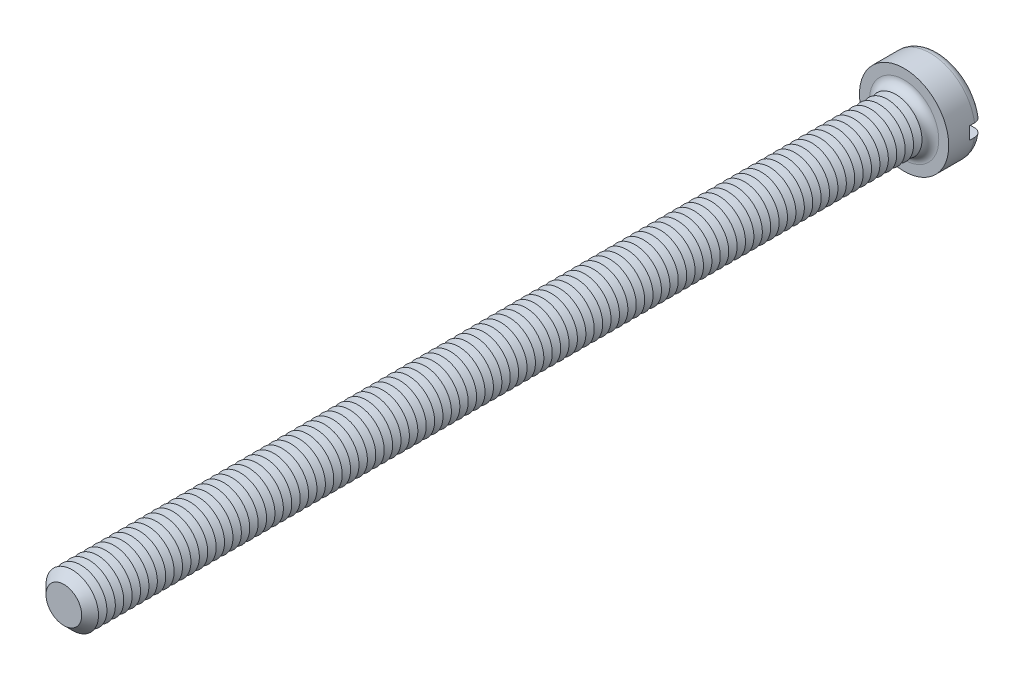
from build123d import *

# Parameters (mm, degrees)
SKETCH3_R           = 4.25
BOSS_EXTRUDE2_DEPTH = 3.3
SKETCH4_R           = 2.5
BOSS_EXTRUDE3_DEPTH = 80
FILLET1_R           = 0.8
CHAMFER1_SIZE       = 0.8
LPATTERN1_COUNT     = 98
LPATTERN1_PITCH     = 0.8
SKETCH8_W           = 8.5
SKETCH8_H           = 1.2
CUT_EXTRUDE1_DEPTH  = 1.3


with BuildPart() as part:
    # Sketch3 → Boss-Extrude2 (new body)
    with BuildSketch(Plane.XY):
        Circle(SKETCH3_R)
    extrude(amount=-BOSS_EXTRUDE2_DEPTH)

    # Sketch4 → Boss-Extrude3 (add)
    with BuildSketch(Plane.XY):
        Circle(SKETCH4_R)
    extrude(amount=BOSS_EXTRUDE3_DEPTH)

    # Fillet1
    fillet1_edges = [part.edges().sort_by_distance(p)[0] for p in [
        (-4.25, 0, -3.3),
        (-2.5, 0, 0),
    ]]
    fillet(fillet1_edges, radius=FILLET1_R)

    # Chamfer1
    chamfer1_edges = [part.edges().sort_by_distance(p)[0] for p in [
        (-2.5, 0, 80),
    ]]
    chamfer(chamfer1_edges, length=CHAMFER1_SIZE)

    # Sketch6 → Cut-Revolve1 (revolve, cut)
    with BuildSketch(Plane(origin=(0, 0, 0), x_dir=(0, 0, -1), z_dir=(1, 0, 0)), mode=Mode.PRIVATE) as cut_revolve1_sk:
        Polygon((-0.8, 2.5), (-1.2, 1.807179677), (-1.6, 2.5), align=None)
    cut_revolve1 = revolve(cut_revolve1_sk.sketch.rotate(Axis((0, 0, -1.694361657), (0, 0, 1)), 90), axis=Axis((0, 0, -1.694361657), (0, 0, 1)), mode=Mode.SUBTRACT)

    # LPattern1: Cut-Revolve1 ×98
    with Locations(*[(0, 0, i * LPATTERN1_PITCH) for i in range(1, LPATTERN1_COUNT)]):
        add(cut_revolve1, mode=Mode.SUBTRACT)

    # Sketch8 → Cut-Extrude1 (cut)
    with BuildSketch(Plane(origin=(0, 0, -3.3), x_dir=(-1, 0, 0), z_dir=(0, 0, -1))):
        Rectangle(SKETCH8_W, SKETCH8_H)
    extrude(amount=-CUT_EXTRUDE1_DEPTH, mode=Mode.SUBTRACT)


solid = part.part
